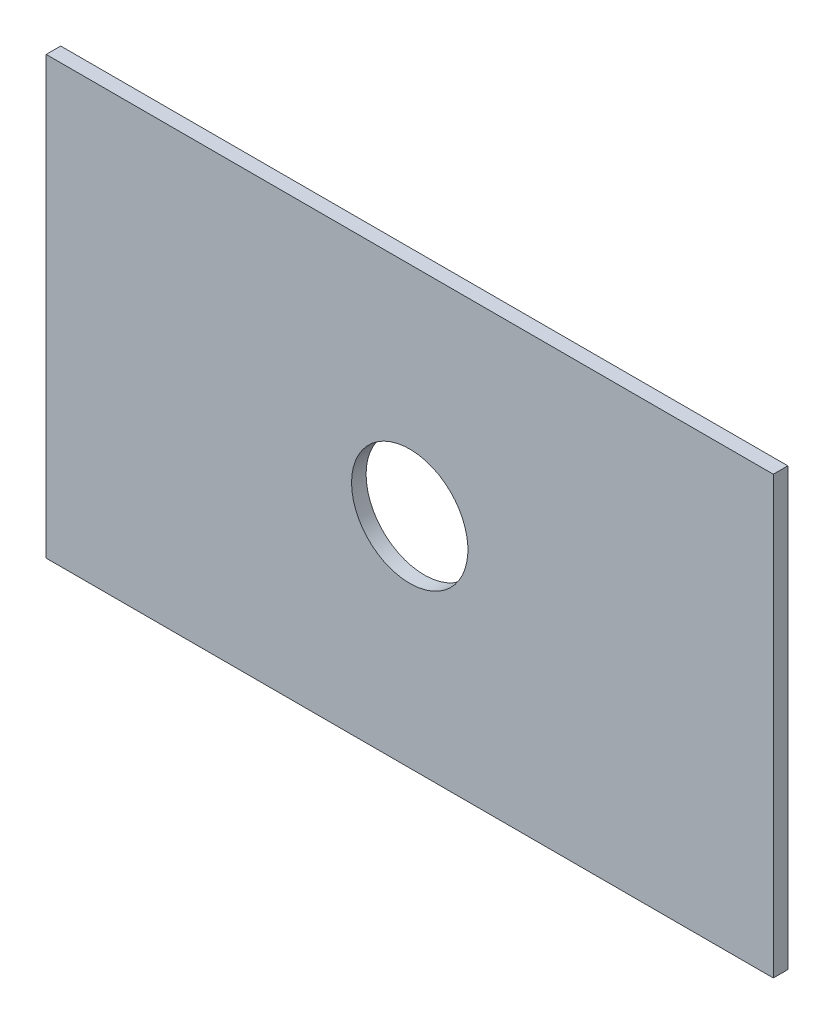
from build123d import *

# Parameters (mm, degrees)
SCHIZZO1_W                   = 50
SCHIZZO1_H                   = 30
SCHIZZO1_R                   = 4
ESTRUSIONE_ESTRUSIONE1_DEPTH = 1


with BuildPart() as part:
    # Schizzo1 → Estrusione-Estrusione1 (new body)
    with BuildSketch(Plane.XY):
        Rectangle(SCHIZZO1_W, SCHIZZO1_H)
        with Locations(Location((0, 0, 0), (0, 0, 180))):
            Circle(SCHIZZO1_R, mode=Mode.SUBTRACT)
    extrude(amount=ESTRUSIONE_ESTRUSIONE1_DEPTH)


solid = part.part
